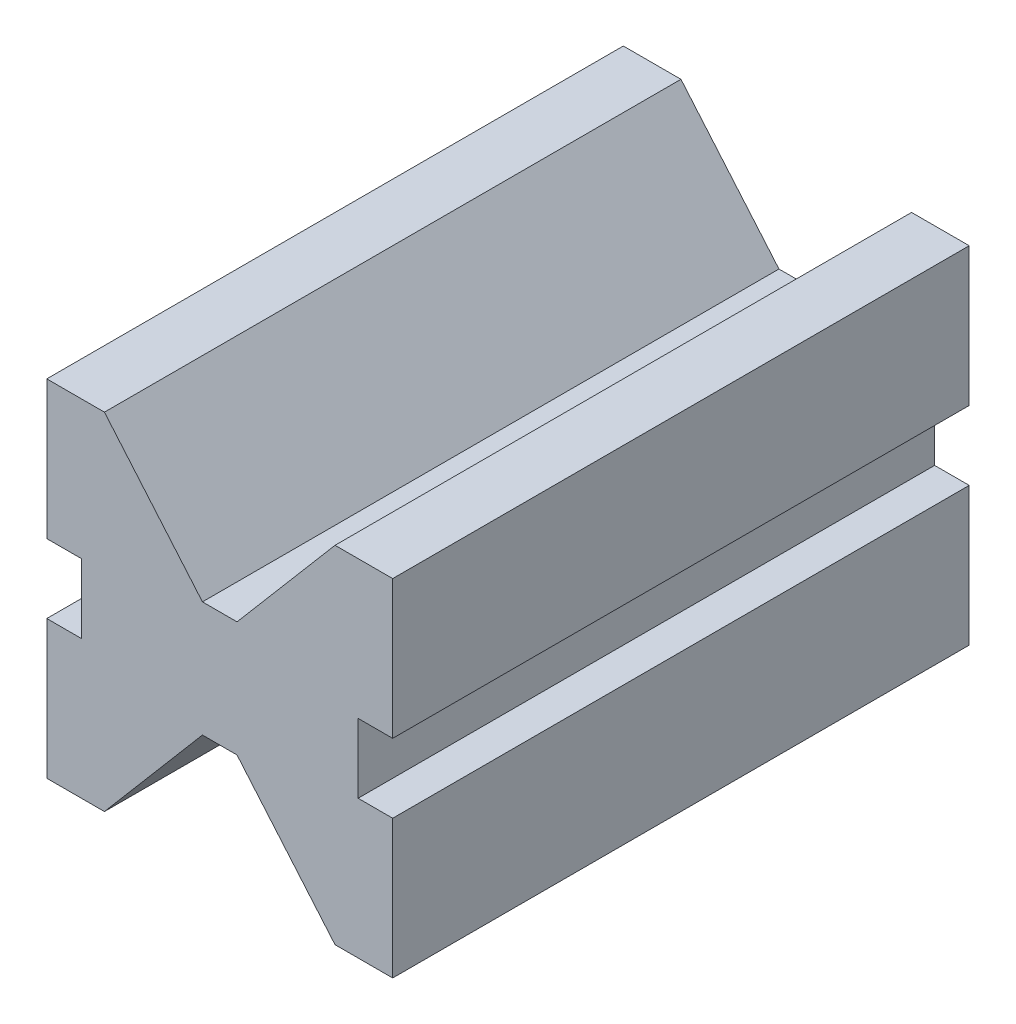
ISO-10303-21;
HEADER;
FILE_DESCRIPTION(('STEP AP214'),'2;1');
FILE_NAME('part.step','',(''),(''),'','','');
FILE_SCHEMA(('AUTOMOTIVE_DESIGN { 1 0 10303 214 1 1 1 1 }'));
ENDSEC;
DATA;
#1=APPLICATION_CONTEXT('core data for automotive mechanical design processes');
#2=APPLICATION_PROTOCOL_DEFINITION('international standard','automotive_design',2000,#1);
#3=PRODUCT_CONTEXT('',#1,'mechanical');
#4=PRODUCT('Part','Part','',(#3));
#5=PRODUCT_RELATED_PRODUCT_CATEGORY('part','',(#4));
#6=PRODUCT_DEFINITION_FORMATION('','',#4);
#7=PRODUCT_DEFINITION_CONTEXT('part definition',#1,'design');
#8=PRODUCT_DEFINITION('design','',#6,#7);
#9=PRODUCT_DEFINITION_SHAPE('','',#8);
#10=(LENGTH_UNIT() NAMED_UNIT(*) SI_UNIT(.MILLI.,.METRE.));
#11=(NAMED_UNIT(*) PLANE_ANGLE_UNIT() SI_UNIT($,.RADIAN.));
#12=(NAMED_UNIT(*) SI_UNIT($,.STERADIAN.) SOLID_ANGLE_UNIT());
#13=UNCERTAINTY_MEASURE_WITH_UNIT(LENGTH_MEASURE(1.E-05),#10,'distance_accuracy_value','');
#14=(GEOMETRIC_REPRESENTATION_CONTEXT(3) GLOBAL_UNCERTAINTY_ASSIGNED_CONTEXT((#13)) GLOBAL_UNIT_ASSIGNED_CONTEXT((#10,
#11,#12)) REPRESENTATION_CONTEXT('',''));
#15=CARTESIAN_POINT('',(0.,0.,0.));
#16=DIRECTION('',(0.,0.,1.));
#17=DIRECTION('',(1.,0.,0.));
#18=AXIS2_PLACEMENT_3D('',#15,#16,#17);
#19=CARTESIAN_POINT('',(-20.,-30.,50.));
#20=DIRECTION('',(-0.761939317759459,0.647648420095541,0.));
#21=DIRECTION('',(-0.647648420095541,-0.761939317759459,0.));
#22=AXIS2_PLACEMENT_3D('',#19,#20,#21);
#23=PLANE('',#22);
#24=DIRECTION('',(0.647648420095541,0.761939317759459,0.));
#25=VECTOR('',#24,1.);
#26=CARTESIAN_POINT('',(-20.,-30.,-50.));
#27=LINE('',#26,#25);
#28=CARTESIAN_POINT('',(-20.,-30.,-50.));
#29=VERTEX_POINT('',#28);
#30=CARTESIAN_POINT('',(-3.,-10.,-50.));
#31=VERTEX_POINT('',#30);
#32=EDGE_CURVE('E206',#29,#31,#27,.T.);
#33=ORIENTED_EDGE('',*,*,#32,.T.);
#34=DIRECTION('',(0.,0.,-1.));
#35=VECTOR('',#34,1.);
#36=CARTESIAN_POINT('',(-3.,-10.,50.));
#37=LINE('',#36,#35);
#38=CARTESIAN_POINT('',(-3.,-10.,50.));
#39=VERTEX_POINT('',#38);
#40=EDGE_CURVE('E11',#39,#31,#37,.T.);
#41=ORIENTED_EDGE('',*,*,#40,.F.);
#42=DIRECTION('',(0.647648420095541,0.761939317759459,0.));
#43=VECTOR('',#42,1.);
#44=CARTESIAN_POINT('',(-20.,-30.,50.));
#45=LINE('',#44,#43);
#46=CARTESIAN_POINT('',(-20.,-30.,50.));
#47=VERTEX_POINT('',#46);
#48=EDGE_CURVE('E244',#47,#39,#45,.T.);
#49=ORIENTED_EDGE('',*,*,#48,.F.);
#50=DIRECTION('',(0.,0.,-1.));
#51=VECTOR('',#50,1.);
#52=CARTESIAN_POINT('',(-20.,-30.,50.));
#53=LINE('',#52,#51);
#54=EDGE_CURVE('E202',#47,#29,#53,.T.);
#55=ORIENTED_EDGE('',*,*,#54,.T.);
#56=EDGE_LOOP('',(#33,#41,#49,#55));
#57=FACE_BOUND('',#56,.T.);
#58=ADVANCED_FACE('F38',(#57),#23,.F.);
#59=CARTESIAN_POINT('',(-3.,-10.,50.));
#60=DIRECTION('',(0.,1.,0.));
#61=DIRECTION('',(0.,0.,1.));
#62=AXIS2_PLACEMENT_3D('',#59,#60,#61);
#63=PLANE('',#62);
#64=DIRECTION('',(1.,0.,0.));
#65=VECTOR('',#64,1.);
#66=CARTESIAN_POINT('',(-3.,-10.,-50.));
#67=LINE('',#66,#65);
#68=CARTESIAN_POINT('',(3.,-10.,-50.));
#69=VERTEX_POINT('',#68);
#70=EDGE_CURVE('E209',#31,#69,#67,.T.);
#71=ORIENTED_EDGE('',*,*,#70,.T.);
#72=DIRECTION('',(0.,0.,-1.));
#73=VECTOR('',#72,1.);
#74=CARTESIAN_POINT('',(3.,-10.,50.));
#75=LINE('',#74,#73);
#76=CARTESIAN_POINT('',(3.,-10.,50.));
#77=VERTEX_POINT('',#76);
#78=EDGE_CURVE('E46',#77,#69,#75,.T.);
#79=ORIENTED_EDGE('',*,*,#78,.F.);
#80=DIRECTION('',(1.,0.,0.));
#81=VECTOR('',#80,1.);
#82=CARTESIAN_POINT('',(-3.,-10.,50.));
#83=LINE('',#82,#81);
#84=EDGE_CURVE('E133',#39,#77,#83,.T.);
#85=ORIENTED_EDGE('',*,*,#84,.F.);
#86=ORIENTED_EDGE('',*,*,#40,.T.);
#87=EDGE_LOOP('',(#71,#79,#85,#86));
#88=FACE_BOUND('',#87,.T.);
#89=ADVANCED_FACE('F362',(#88),#63,.F.);
#90=CARTESIAN_POINT('',(3.,-10.,50.));
#91=DIRECTION('',(0.761939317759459,0.647648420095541,0.));
#92=DIRECTION('',(-0.647648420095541,0.761939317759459,0.));
#93=AXIS2_PLACEMENT_3D('',#90,#91,#92);
#94=PLANE('',#93);
#95=DIRECTION('',(0.647648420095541,-0.761939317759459,0.));
#96=VECTOR('',#95,1.);
#97=CARTESIAN_POINT('',(3.,-10.,-50.));
#98=LINE('',#97,#96);
#99=CARTESIAN_POINT('',(20.,-30.,-50.));
#100=VERTEX_POINT('',#99);
#101=EDGE_CURVE('E211',#69,#100,#98,.T.);
#102=ORIENTED_EDGE('',*,*,#101,.T.);
#103=DIRECTION('',(0.,0.,-1.));
#104=VECTOR('',#103,1.);
#105=CARTESIAN_POINT('',(20.,-30.,50.));
#106=LINE('',#105,#104);
#107=CARTESIAN_POINT('',(20.,-30.,50.));
#108=VERTEX_POINT('',#107);
#109=EDGE_CURVE('E287',#108,#100,#106,.T.);
#110=ORIENTED_EDGE('',*,*,#109,.F.);
#111=DIRECTION('',(0.647648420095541,-0.761939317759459,0.));
#112=VECTOR('',#111,1.);
#113=CARTESIAN_POINT('',(3.,-10.,50.));
#114=LINE('',#113,#112);
#115=EDGE_CURVE('E295',#77,#108,#114,.T.);
#116=ORIENTED_EDGE('',*,*,#115,.F.);
#117=ORIENTED_EDGE('',*,*,#78,.T.);
#118=EDGE_LOOP('',(#102,#110,#116,#117));
#119=FACE_BOUND('',#118,.T.);
#120=ADVANCED_FACE('F293',(#119),#94,.F.);
#121=CARTESIAN_POINT('',(20.,-30.,50.));
#122=DIRECTION('',(0.,1.,0.));
#123=DIRECTION('',(-1.,0.,0.));
#124=AXIS2_PLACEMENT_3D('',#121,#122,#123);
#125=PLANE('',#124);
#126=DIRECTION('',(1.,0.,0.));
#127=VECTOR('',#126,1.);
#128=CARTESIAN_POINT('',(20.,-30.,-50.));
#129=LINE('',#128,#127);
#130=CARTESIAN_POINT('',(30.,-30.,-50.));
#131=VERTEX_POINT('',#130);
#132=EDGE_CURVE('E213',#100,#131,#129,.T.);
#133=ORIENTED_EDGE('',*,*,#132,.T.);
#134=DIRECTION('',(0.,0.,-1.));
#135=VECTOR('',#134,1.);
#136=CARTESIAN_POINT('',(30.,-30.,50.));
#137=LINE('',#136,#135);
#138=CARTESIAN_POINT('',(30.,-30.,50.));
#139=VERTEX_POINT('',#138);
#140=EDGE_CURVE('E284',#139,#131,#137,.T.);
#141=ORIENTED_EDGE('',*,*,#140,.F.);
#142=DIRECTION('',(1.,0.,0.));
#143=VECTOR('',#142,1.);
#144=CARTESIAN_POINT('',(20.,-30.,50.));
#145=LINE('',#144,#143);
#146=EDGE_CURVE('E313',#108,#139,#145,.T.);
#147=ORIENTED_EDGE('',*,*,#146,.F.);
#148=ORIENTED_EDGE('',*,*,#109,.T.);
#149=EDGE_LOOP('',(#133,#141,#147,#148));
#150=FACE_BOUND('',#149,.T.);
#151=ADVANCED_FACE('F304',(#150),#125,.F.);
#152=CARTESIAN_POINT('',(30.,-30.,50.));
#153=DIRECTION('',(-1.,0.,0.));
#154=DIRECTION('',(0.,-1.,0.));
#155=AXIS2_PLACEMENT_3D('',#152,#153,#154);
#156=PLANE('',#155);
#157=DIRECTION('',(0.,1.,0.));
#158=VECTOR('',#157,1.);
#159=CARTESIAN_POINT('',(30.,-30.,-50.));
#160=LINE('',#159,#158);
#161=CARTESIAN_POINT('',(30.,-6.,-50.));
#162=VERTEX_POINT('',#161);
#163=EDGE_CURVE('E215',#131,#162,#160,.T.);
#164=ORIENTED_EDGE('',*,*,#163,.T.);
#165=DIRECTION('',(0.,0.,-1.));
#166=VECTOR('',#165,1.);
#167=CARTESIAN_POINT('',(30.,-6.,50.));
#168=LINE('',#167,#166);
#169=CARTESIAN_POINT('',(30.,-6.,50.));
#170=VERTEX_POINT('',#169);
#171=EDGE_CURVE('E281',#170,#162,#168,.T.);
#172=ORIENTED_EDGE('',*,*,#171,.F.);
#173=DIRECTION('',(0.,1.,0.));
#174=VECTOR('',#173,1.);
#175=CARTESIAN_POINT('',(30.,-30.,50.));
#176=LINE('',#175,#174);
#177=EDGE_CURVE('E310',#139,#170,#176,.T.);
#178=ORIENTED_EDGE('',*,*,#177,.F.);
#179=ORIENTED_EDGE('',*,*,#140,.T.);
#180=EDGE_LOOP('',(#164,#172,#178,#179));
#181=FACE_BOUND('',#180,.T.);
#182=ADVANCED_FACE('F308',(#181),#156,.F.);
#183=CARTESIAN_POINT('',(30.,-6.,50.));
#184=DIRECTION('',(0.,-1.,0.));
#185=DIRECTION('',(0.,0.,-1.));
#186=AXIS2_PLACEMENT_3D('',#183,#184,#185);
#187=PLANE('',#186);
#188=DIRECTION('',(-1.,0.,0.));
#189=VECTOR('',#188,1.);
#190=CARTESIAN_POINT('',(30.,-6.,-50.));
#191=LINE('',#190,#189);
#192=CARTESIAN_POINT('',(24.,-6.,-50.));
#193=VERTEX_POINT('',#192);
#194=EDGE_CURVE('E217',#162,#193,#191,.T.);
#195=ORIENTED_EDGE('',*,*,#194,.T.);
#196=DIRECTION('',(0.,0.,-1.));
#197=VECTOR('',#196,1.);
#198=CARTESIAN_POINT('',(24.,-6.,50.));
#199=LINE('',#198,#197);
#200=CARTESIAN_POINT('',(24.,-6.,50.));
#201=VERTEX_POINT('',#200);
#202=EDGE_CURVE('E278',#201,#193,#199,.T.);
#203=ORIENTED_EDGE('',*,*,#202,.F.);
#204=DIRECTION('',(-1.,0.,0.));
#205=VECTOR('',#204,1.);
#206=CARTESIAN_POINT('',(30.,-6.,50.));
#207=LINE('',#206,#205);
#208=EDGE_CURVE('E312',#170,#201,#207,.T.);
#209=ORIENTED_EDGE('',*,*,#208,.F.);
#210=ORIENTED_EDGE('',*,*,#171,.T.);
#211=EDGE_LOOP('',(#195,#203,#209,#210));
#212=FACE_BOUND('',#211,.T.);
#213=ADVANCED_FACE('F375',(#212),#187,.F.);
#214=CARTESIAN_POINT('',(24.,-6.,50.));
#215=DIRECTION('',(-1.,0.,0.));
#216=DIRECTION('',(0.,0.,1.));
#217=AXIS2_PLACEMENT_3D('',#214,#215,#216);
#218=PLANE('',#217);
#219=DIRECTION('',(0.,1.,0.));
#220=VECTOR('',#219,1.);
#221=CARTESIAN_POINT('',(24.,-6.,-50.));
#222=LINE('',#221,#220);
#223=CARTESIAN_POINT('',(24.,6.,-50.));
#224=VERTEX_POINT('',#223);
#225=EDGE_CURVE('E219',#193,#224,#222,.T.);
#226=ORIENTED_EDGE('',*,*,#225,.T.);
#227=DIRECTION('',(0.,0.,-1.));
#228=VECTOR('',#227,1.);
#229=CARTESIAN_POINT('',(24.,6.,50.));
#230=LINE('',#229,#228);
#231=CARTESIAN_POINT('',(24.,6.,50.));
#232=VERTEX_POINT('',#231);
#233=EDGE_CURVE('E275',#232,#224,#230,.T.);
#234=ORIENTED_EDGE('',*,*,#233,.F.);
#235=DIRECTION('',(0.,1.,0.));
#236=VECTOR('',#235,1.);
#237=CARTESIAN_POINT('',(24.,-6.,50.));
#238=LINE('',#237,#236);
#239=EDGE_CURVE('E315',#201,#232,#238,.T.);
#240=ORIENTED_EDGE('',*,*,#239,.F.);
#241=ORIENTED_EDGE('',*,*,#202,.T.);
#242=EDGE_LOOP('',(#226,#234,#240,#241));
#243=FACE_BOUND('',#242,.T.);
#244=ADVANCED_FACE('F378',(#243),#218,.F.);
#245=CARTESIAN_POINT('',(24.,6.,50.));
#246=DIRECTION('',(0.,1.,0.));
#247=DIRECTION('',(0.,0.,1.));
#248=AXIS2_PLACEMENT_3D('',#245,#246,#247);
#249=PLANE('',#248);
#250=DIRECTION('',(1.,0.,0.));
#251=VECTOR('',#250,1.);
#252=CARTESIAN_POINT('',(24.,6.,-50.));
#253=LINE('',#252,#251);
#254=CARTESIAN_POINT('',(30.,6.,-50.));
#255=VERTEX_POINT('',#254);
#256=EDGE_CURVE('E221',#224,#255,#253,.T.);
#257=ORIENTED_EDGE('',*,*,#256,.T.);
#258=DIRECTION('',(0.,0.,-1.));
#259=VECTOR('',#258,1.);
#260=CARTESIAN_POINT('',(30.,6.,50.));
#261=LINE('',#260,#259);
#262=CARTESIAN_POINT('',(30.,6.,50.));
#263=VERTEX_POINT('',#262);
#264=EDGE_CURVE('E272',#263,#255,#261,.T.);
#265=ORIENTED_EDGE('',*,*,#264,.F.);
#266=DIRECTION('',(1.,0.,0.));
#267=VECTOR('',#266,1.);
#268=CARTESIAN_POINT('',(24.,6.,50.));
#269=LINE('',#268,#267);
#270=EDGE_CURVE('E321',#232,#263,#269,.T.);
#271=ORIENTED_EDGE('',*,*,#270,.F.);
#272=ORIENTED_EDGE('',*,*,#233,.T.);
#273=EDGE_LOOP('',(#257,#265,#271,#272));
#274=FACE_BOUND('',#273,.T.);
#275=ADVANCED_FACE('F382',(#274),#249,.F.);
#276=CARTESIAN_POINT('',(30.,6.,50.));
#277=DIRECTION('',(-1.,0.,0.));
#278=DIRECTION('',(0.,-1.,0.));
#279=AXIS2_PLACEMENT_3D('',#276,#277,#278);
#280=PLANE('',#279);
#281=DIRECTION('',(0.,1.,0.));
#282=VECTOR('',#281,1.);
#283=CARTESIAN_POINT('',(30.,6.,-50.));
#284=LINE('',#283,#282);
#285=CARTESIAN_POINT('',(30.,30.,-50.));
#286=VERTEX_POINT('',#285);
#287=EDGE_CURVE('E223',#255,#286,#284,.T.);
#288=ORIENTED_EDGE('',*,*,#287,.T.);
#289=DIRECTION('',(0.,0.,-1.));
#290=VECTOR('',#289,1.);
#291=CARTESIAN_POINT('',(30.,30.,50.));
#292=LINE('',#291,#290);
#293=CARTESIAN_POINT('',(30.,30.,50.));
#294=VERTEX_POINT('',#293);
#295=EDGE_CURVE('E269',#294,#286,#292,.T.);
#296=ORIENTED_EDGE('',*,*,#295,.F.);
#297=DIRECTION('',(0.,1.,0.));
#298=VECTOR('',#297,1.);
#299=CARTESIAN_POINT('',(30.,6.,50.));
#300=LINE('',#299,#298);
#301=EDGE_CURVE('E323',#263,#294,#300,.T.);
#302=ORIENTED_EDGE('',*,*,#301,.F.);
#303=ORIENTED_EDGE('',*,*,#264,.T.);
#304=EDGE_LOOP('',(#288,#296,#302,#303));
#305=FACE_BOUND('',#304,.T.);
#306=ADVANCED_FACE('F386',(#305),#280,.F.);
#307=CARTESIAN_POINT('',(30.,30.,50.));
#308=DIRECTION('',(0.,-1.,0.));
#309=DIRECTION('',(1.,0.,0.));
#310=AXIS2_PLACEMENT_3D('',#307,#308,#309);
#311=PLANE('',#310);
#312=DIRECTION('',(-1.,0.,0.));
#313=VECTOR('',#312,1.);
#314=CARTESIAN_POINT('',(30.,30.,-50.));
#315=LINE('',#314,#313);
#316=CARTESIAN_POINT('',(20.,30.,-50.));
#317=VERTEX_POINT('',#316);
#318=EDGE_CURVE('E225',#286,#317,#315,.T.);
#319=ORIENTED_EDGE('',*,*,#318,.T.);
#320=DIRECTION('',(0.,0.,-1.));
#321=VECTOR('',#320,1.);
#322=CARTESIAN_POINT('',(20.,30.,50.));
#323=LINE('',#322,#321);
#324=CARTESIAN_POINT('',(20.,30.,50.));
#325=VERTEX_POINT('',#324);
#326=EDGE_CURVE('E266',#325,#317,#323,.T.);
#327=ORIENTED_EDGE('',*,*,#326,.F.);
#328=DIRECTION('',(-1.,0.,0.));
#329=VECTOR('',#328,1.);
#330=CARTESIAN_POINT('',(30.,30.,50.));
#331=LINE('',#330,#329);
#332=EDGE_CURVE('E325',#294,#325,#331,.T.);
#333=ORIENTED_EDGE('',*,*,#332,.F.);
#334=ORIENTED_EDGE('',*,*,#295,.T.);
#335=EDGE_LOOP('',(#319,#327,#333,#334));
#336=FACE_BOUND('',#335,.T.);
#337=ADVANCED_FACE('F390',(#336),#311,.F.);
#338=CARTESIAN_POINT('',(20.,30.,50.));
#339=DIRECTION('',(0.761939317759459,-0.647648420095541,0.));
#340=DIRECTION('',(0.647648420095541,0.761939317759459,0.));
#341=AXIS2_PLACEMENT_3D('',#338,#339,#340);
#342=PLANE('',#341);
#343=DIRECTION('',(-0.647648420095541,-0.761939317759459,0.));
#344=VECTOR('',#343,1.);
#345=CARTESIAN_POINT('',(20.,30.,-50.));
#346=LINE('',#345,#344);
#347=CARTESIAN_POINT('',(3.,10.,-50.));
#348=VERTEX_POINT('',#347);
#349=EDGE_CURVE('E227',#317,#348,#346,.T.);
#350=ORIENTED_EDGE('',*,*,#349,.T.);
#351=DIRECTION('',(0.,0.,-1.));
#352=VECTOR('',#351,1.);
#353=CARTESIAN_POINT('',(3.,10.,50.));
#354=LINE('',#353,#352);
#355=CARTESIAN_POINT('',(3.,10.,50.));
#356=VERTEX_POINT('',#355);
#357=EDGE_CURVE('E263',#356,#348,#354,.T.);
#358=ORIENTED_EDGE('',*,*,#357,.F.);
#359=DIRECTION('',(-0.647648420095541,-0.761939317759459,0.));
#360=VECTOR('',#359,1.);
#361=CARTESIAN_POINT('',(20.,30.,50.));
#362=LINE('',#361,#360);
#363=EDGE_CURVE('E327',#325,#356,#362,.T.);
#364=ORIENTED_EDGE('',*,*,#363,.F.);
#365=ORIENTED_EDGE('',*,*,#326,.T.);
#366=EDGE_LOOP('',(#350,#358,#364,#365));
#367=FACE_BOUND('',#366,.T.);
#368=ADVANCED_FACE('F394',(#367),#342,.F.);
#369=CARTESIAN_POINT('',(3.,10.,50.));
#370=DIRECTION('',(0.,-1.,0.));
#371=DIRECTION('',(0.,0.,-1.));
#372=AXIS2_PLACEMENT_3D('',#369,#370,#371);
#373=PLANE('',#372);
#374=DIRECTION('',(-1.,0.,0.));
#375=VECTOR('',#374,1.);
#376=CARTESIAN_POINT('',(3.,10.,-50.));
#377=LINE('',#376,#375);
#378=CARTESIAN_POINT('',(-3.,10.,-50.));
#379=VERTEX_POINT('',#378);
#380=EDGE_CURVE('E229',#348,#379,#377,.T.);
#381=ORIENTED_EDGE('',*,*,#380,.T.);
#382=DIRECTION('',(0.,0.,-1.));
#383=VECTOR('',#382,1.);
#384=CARTESIAN_POINT('',(-3.,10.,50.));
#385=LINE('',#384,#383);
#386=CARTESIAN_POINT('',(-3.,10.,50.));
#387=VERTEX_POINT('',#386);
#388=EDGE_CURVE('E260',#387,#379,#385,.T.);
#389=ORIENTED_EDGE('',*,*,#388,.F.);
#390=DIRECTION('',(-1.,0.,0.));
#391=VECTOR('',#390,1.);
#392=CARTESIAN_POINT('',(3.,10.,50.));
#393=LINE('',#392,#391);
#394=EDGE_CURVE('E329',#356,#387,#393,.T.);
#395=ORIENTED_EDGE('',*,*,#394,.F.);
#396=ORIENTED_EDGE('',*,*,#357,.T.);
#397=EDGE_LOOP('',(#381,#389,#395,#396));
#398=FACE_BOUND('',#397,.T.);
#399=ADVANCED_FACE('F398',(#398),#373,.F.);
#400=CARTESIAN_POINT('',(-3.,10.,50.));
#401=DIRECTION('',(-0.761939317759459,-0.647648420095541,0.));
#402=DIRECTION('',(0.647648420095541,-0.761939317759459,0.));
#403=AXIS2_PLACEMENT_3D('',#400,#401,#402);
#404=PLANE('',#403);
#405=DIRECTION('',(-0.647648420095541,0.761939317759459,0.));
#406=VECTOR('',#405,1.);
#407=CARTESIAN_POINT('',(-3.,10.,-50.));
#408=LINE('',#407,#406);
#409=CARTESIAN_POINT('',(-20.,30.,-50.));
#410=VERTEX_POINT('',#409);
#411=EDGE_CURVE('E231',#379,#410,#408,.T.);
#412=ORIENTED_EDGE('',*,*,#411,.T.);
#413=DIRECTION('',(0.,0.,-1.));
#414=VECTOR('',#413,1.);
#415=CARTESIAN_POINT('',(-20.,30.,50.));
#416=LINE('',#415,#414);
#417=CARTESIAN_POINT('',(-20.,30.,50.));
#418=VERTEX_POINT('',#417);
#419=EDGE_CURVE('E257',#418,#410,#416,.T.);
#420=ORIENTED_EDGE('',*,*,#419,.F.);
#421=DIRECTION('',(-0.647648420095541,0.761939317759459,0.));
#422=VECTOR('',#421,1.);
#423=CARTESIAN_POINT('',(-3.,10.,50.));
#424=LINE('',#423,#422);
#425=EDGE_CURVE('E331',#387,#418,#424,.T.);
#426=ORIENTED_EDGE('',*,*,#425,.F.);
#427=ORIENTED_EDGE('',*,*,#388,.T.);
#428=EDGE_LOOP('',(#412,#420,#426,#427));
#429=FACE_BOUND('',#428,.T.);
#430=ADVANCED_FACE('F402',(#429),#404,.F.);
#431=CARTESIAN_POINT('',(-20.,30.,50.));
#432=DIRECTION('',(0.,-1.,0.));
#433=DIRECTION('',(1.,0.,0.));
#434=AXIS2_PLACEMENT_3D('',#431,#432,#433);
#435=PLANE('',#434);
#436=DIRECTION('',(-1.,0.,0.));
#437=VECTOR('',#436,1.);
#438=CARTESIAN_POINT('',(-20.,30.,-50.));
#439=LINE('',#438,#437);
#440=CARTESIAN_POINT('',(-30.,30.,-50.));
#441=VERTEX_POINT('',#440);
#442=EDGE_CURVE('E233',#410,#441,#439,.T.);
#443=ORIENTED_EDGE('',*,*,#442,.T.);
#444=DIRECTION('',(0.,0.,-1.));
#445=VECTOR('',#444,1.);
#446=CARTESIAN_POINT('',(-30.,30.,50.));
#447=LINE('',#446,#445);
#448=CARTESIAN_POINT('',(-30.,30.,50.));
#449=VERTEX_POINT('',#448);
#450=EDGE_CURVE('E254',#449,#441,#447,.T.);
#451=ORIENTED_EDGE('',*,*,#450,.F.);
#452=DIRECTION('',(-1.,0.,0.));
#453=VECTOR('',#452,1.);
#454=CARTESIAN_POINT('',(-20.,30.,50.));
#455=LINE('',#454,#453);
#456=EDGE_CURVE('E333',#418,#449,#455,.T.);
#457=ORIENTED_EDGE('',*,*,#456,.F.);
#458=ORIENTED_EDGE('',*,*,#419,.T.);
#459=EDGE_LOOP('',(#443,#451,#457,#458));
#460=FACE_BOUND('',#459,.T.);
#461=ADVANCED_FACE('F406',(#460),#435,.F.);
#462=CARTESIAN_POINT('',(-30.,30.,50.));
#463=DIRECTION('',(1.,0.,0.));
#464=DIRECTION('',(0.,1.,0.));
#465=AXIS2_PLACEMENT_3D('',#462,#463,#464);
#466=PLANE('',#465);
#467=DIRECTION('',(0.,-1.,0.));
#468=VECTOR('',#467,1.);
#469=CARTESIAN_POINT('',(-30.,30.,-50.));
#470=LINE('',#469,#468);
#471=CARTESIAN_POINT('',(-30.,5.99999999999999,-50.));
#472=VERTEX_POINT('',#471);
#473=EDGE_CURVE('E235',#441,#472,#470,.T.);
#474=ORIENTED_EDGE('',*,*,#473,.T.);
#475=DIRECTION('',(0.,0.,-1.));
#476=VECTOR('',#475,1.);
#477=CARTESIAN_POINT('',(-30.,5.99999999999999,50.));
#478=LINE('',#477,#476);
#479=CARTESIAN_POINT('',(-30.,5.99999999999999,50.));
#480=VERTEX_POINT('',#479);
#481=EDGE_CURVE('E251',#480,#472,#478,.T.);
#482=ORIENTED_EDGE('',*,*,#481,.F.);
#483=DIRECTION('',(0.,-1.,0.));
#484=VECTOR('',#483,1.);
#485=CARTESIAN_POINT('',(-30.,30.,50.));
#486=LINE('',#485,#484);
#487=EDGE_CURVE('E335',#449,#480,#486,.T.);
#488=ORIENTED_EDGE('',*,*,#487,.F.);
#489=ORIENTED_EDGE('',*,*,#450,.T.);
#490=EDGE_LOOP('',(#474,#482,#488,#489));
#491=FACE_BOUND('',#490,.T.);
#492=ADVANCED_FACE('F410',(#491),#466,.F.);
#493=CARTESIAN_POINT('',(-30.,5.99999999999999,50.));
#494=DIRECTION('',(0.,1.,0.));
#495=DIRECTION('',(-1.,0.,0.));
#496=AXIS2_PLACEMENT_3D('',#493,#494,#495);
#497=PLANE('',#496);
#498=DIRECTION('',(1.,0.,0.));
#499=VECTOR('',#498,1.);
#500=CARTESIAN_POINT('',(-30.,5.99999999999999,-50.));
#501=LINE('',#500,#499);
#502=CARTESIAN_POINT('',(-24.,5.99999999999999,-50.));
#503=VERTEX_POINT('',#502);
#504=EDGE_CURVE('E237',#472,#503,#501,.T.);
#505=ORIENTED_EDGE('',*,*,#504,.T.);
#506=DIRECTION('',(0.,0.,-1.));
#507=VECTOR('',#506,1.);
#508=CARTESIAN_POINT('',(-24.,5.99999999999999,50.));
#509=LINE('',#508,#507);
#510=CARTESIAN_POINT('',(-24.,5.99999999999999,50.));
#511=VERTEX_POINT('',#510);
#512=EDGE_CURVE('E248',#511,#503,#509,.T.);
#513=ORIENTED_EDGE('',*,*,#512,.F.);
#514=DIRECTION('',(1.,0.,0.));
#515=VECTOR('',#514,1.);
#516=CARTESIAN_POINT('',(-30.,5.99999999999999,50.));
#517=LINE('',#516,#515);
#518=EDGE_CURVE('E337',#480,#511,#517,.T.);
#519=ORIENTED_EDGE('',*,*,#518,.F.);
#520=ORIENTED_EDGE('',*,*,#481,.T.);
#521=EDGE_LOOP('',(#505,#513,#519,#520));
#522=FACE_BOUND('',#521,.T.);
#523=ADVANCED_FACE('F343',(#522),#497,.F.);
#524=CARTESIAN_POINT('',(-24.,5.99999999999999,50.));
#525=DIRECTION('',(1.,0.,0.));
#526=DIRECTION('',(0.,0.,-1.));
#527=AXIS2_PLACEMENT_3D('',#524,#525,#526);
#528=PLANE('',#527);
#529=DIRECTION('',(0.,-1.,0.));
#530=VECTOR('',#529,1.);
#531=CARTESIAN_POINT('',(-24.,5.99999999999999,-50.));
#532=LINE('',#531,#530);
#533=CARTESIAN_POINT('',(-24.,-6.00000000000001,-50.));
#534=VERTEX_POINT('',#533);
#535=EDGE_CURVE('E239',#503,#534,#532,.T.);
#536=ORIENTED_EDGE('',*,*,#535,.T.);
#537=DIRECTION('',(0.,0.,-1.));
#538=VECTOR('',#537,1.);
#539=CARTESIAN_POINT('',(-24.,-6.00000000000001,50.));
#540=LINE('',#539,#538);
#541=CARTESIAN_POINT('',(-24.,-6.00000000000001,50.));
#542=VERTEX_POINT('',#541);
#543=EDGE_CURVE('E197',#542,#534,#540,.T.);
#544=ORIENTED_EDGE('',*,*,#543,.F.);
#545=DIRECTION('',(0.,-1.,0.));
#546=VECTOR('',#545,1.);
#547=CARTESIAN_POINT('',(-24.,5.99999999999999,50.));
#548=LINE('',#547,#546);
#549=EDGE_CURVE('E188',#511,#542,#548,.T.);
#550=ORIENTED_EDGE('',*,*,#549,.F.);
#551=ORIENTED_EDGE('',*,*,#512,.T.);
#552=EDGE_LOOP('',(#536,#544,#550,#551));
#553=FACE_BOUND('',#552,.T.);
#554=ADVANCED_FACE('F347',(#553),#528,.F.);
#555=CARTESIAN_POINT('',(-24.,-6.00000000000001,50.));
#556=DIRECTION('',(0.,-1.,0.));
#557=DIRECTION('',(1.,0.,0.));
#558=AXIS2_PLACEMENT_3D('',#555,#556,#557);
#559=PLANE('',#558);
#560=DIRECTION('',(-1.,0.,0.));
#561=VECTOR('',#560,1.);
#562=CARTESIAN_POINT('',(-24.,-6.00000000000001,-50.));
#563=LINE('',#562,#561);
#564=CARTESIAN_POINT('',(-30.,-6.00000000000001,-50.));
#565=VERTEX_POINT('',#564);
#566=EDGE_CURVE('E196',#534,#565,#563,.T.);
#567=ORIENTED_EDGE('',*,*,#566,.T.);
#568=DIRECTION('',(0.,0.,-1.));
#569=VECTOR('',#568,1.);
#570=CARTESIAN_POINT('',(-30.,-6.00000000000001,50.));
#571=LINE('',#570,#569);
#572=CARTESIAN_POINT('',(-30.,-6.00000000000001,50.));
#573=VERTEX_POINT('',#572);
#574=EDGE_CURVE('E193',#573,#565,#571,.T.);
#575=ORIENTED_EDGE('',*,*,#574,.F.);
#576=DIRECTION('',(-1.,0.,0.));
#577=VECTOR('',#576,1.);
#578=CARTESIAN_POINT('',(-24.,-6.00000000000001,50.));
#579=LINE('',#578,#577);
#580=EDGE_CURVE('E182',#542,#573,#579,.T.);
#581=ORIENTED_EDGE('',*,*,#580,.F.);
#582=ORIENTED_EDGE('',*,*,#543,.T.);
#583=EDGE_LOOP('',(#567,#575,#581,#582));
#584=FACE_BOUND('',#583,.T.);
#585=ADVANCED_FACE('F194',(#584),#559,.F.);
#586=CARTESIAN_POINT('',(-30.,-6.00000000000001,50.));
#587=DIRECTION('',(1.,0.,0.));
#588=DIRECTION('',(0.,1.,0.));
#589=AXIS2_PLACEMENT_3D('',#586,#587,#588);
#590=PLANE('',#589);
#591=DIRECTION('',(0.,-1.,0.));
#592=VECTOR('',#591,1.);
#593=CARTESIAN_POINT('',(-30.,-6.00000000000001,-50.));
#594=LINE('',#593,#592);
#595=CARTESIAN_POINT('',(-30.,-30.,-50.));
#596=VERTEX_POINT('',#595);
#597=EDGE_CURVE('E119',#565,#596,#594,.T.);
#598=ORIENTED_EDGE('',*,*,#597,.T.);
#599=DIRECTION('',(0.,0.,-1.));
#600=VECTOR('',#599,1.);
#601=CARTESIAN_POINT('',(-30.,-30.,50.));
#602=LINE('',#601,#600);
#603=CARTESIAN_POINT('',(-30.,-30.,50.));
#604=VERTEX_POINT('',#603);
#605=EDGE_CURVE('E198',#604,#596,#602,.T.);
#606=ORIENTED_EDGE('',*,*,#605,.F.);
#607=DIRECTION('',(0.,-1.,0.));
#608=VECTOR('',#607,1.);
#609=CARTESIAN_POINT('',(-30.,-6.00000000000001,50.));
#610=LINE('',#609,#608);
#611=EDGE_CURVE('E186',#573,#604,#610,.T.);
#612=ORIENTED_EDGE('',*,*,#611,.F.);
#613=ORIENTED_EDGE('',*,*,#574,.T.);
#614=EDGE_LOOP('',(#598,#606,#612,#613));
#615=FACE_BOUND('',#614,.T.);
#616=ADVANCED_FACE('F200',(#615),#590,.F.);
#617=CARTESIAN_POINT('',(-30.,-30.,50.));
#618=DIRECTION('',(0.,1.,0.));
#619=DIRECTION('',(0.,0.,1.));
#620=AXIS2_PLACEMENT_3D('',#617,#618,#619);
#621=PLANE('',#620);
#622=DIRECTION('',(1.,0.,0.));
#623=VECTOR('',#622,1.);
#624=CARTESIAN_POINT('',(-30.,-30.,-50.));
#625=LINE('',#624,#623);
#626=EDGE_CURVE('E125',#596,#29,#625,.T.);
#627=ORIENTED_EDGE('',*,*,#626,.T.);
#628=ORIENTED_EDGE('',*,*,#54,.F.);
#629=DIRECTION('',(1.,0.,0.));
#630=VECTOR('',#629,1.);
#631=CARTESIAN_POINT('',(-30.,-30.,50.));
#632=LINE('',#631,#630);
#633=EDGE_CURVE('E54',#604,#47,#632,.T.);
#634=ORIENTED_EDGE('',*,*,#633,.F.);
#635=ORIENTED_EDGE('',*,*,#605,.T.);
#636=EDGE_LOOP('',(#627,#628,#634,#635));
#637=FACE_BOUND('',#636,.T.);
#638=ADVANCED_FACE('F351',(#637),#621,.F.);
#639=CARTESIAN_POINT('',(0.,0.,50.));
#640=DIRECTION('',(0.,0.,-1.));
#641=DIRECTION('',(-1.,0.,0.));
#642=AXIS2_PLACEMENT_3D('',#639,#640,#641);
#643=PLANE('',#642);
#644=ORIENTED_EDGE('',*,*,#48,.T.);
#645=ORIENTED_EDGE('',*,*,#84,.T.);
#646=ORIENTED_EDGE('',*,*,#115,.T.);
#647=ORIENTED_EDGE('',*,*,#146,.T.);
#648=ORIENTED_EDGE('',*,*,#177,.T.);
#649=ORIENTED_EDGE('',*,*,#208,.T.);
#650=ORIENTED_EDGE('',*,*,#239,.T.);
#651=ORIENTED_EDGE('',*,*,#270,.T.);
#652=ORIENTED_EDGE('',*,*,#301,.T.);
#653=ORIENTED_EDGE('',*,*,#332,.T.);
#654=ORIENTED_EDGE('',*,*,#363,.T.);
#655=ORIENTED_EDGE('',*,*,#394,.T.);
#656=ORIENTED_EDGE('',*,*,#425,.T.);
#657=ORIENTED_EDGE('',*,*,#456,.T.);
#658=ORIENTED_EDGE('',*,*,#487,.T.);
#659=ORIENTED_EDGE('',*,*,#518,.T.);
#660=ORIENTED_EDGE('',*,*,#549,.T.);
#661=ORIENTED_EDGE('',*,*,#580,.T.);
#662=ORIENTED_EDGE('',*,*,#611,.T.);
#663=ORIENTED_EDGE('',*,*,#633,.T.);
#664=EDGE_LOOP('',(#644,#645,#646,#647,#648,#649,#650,#651,#652,#653,#654,#655,#656,#657,#658,
#659,#660,#661,#662,#663));
#665=FACE_BOUND('',#664,.T.);
#666=ADVANCED_FACE('F184',(#665),#643,.F.);
#667=CARTESIAN_POINT('',(0.,0.,-50.));
#668=DIRECTION('',(0.,0.,-1.));
#669=DIRECTION('',(-1.,0.,0.));
#670=AXIS2_PLACEMENT_3D('',#667,#668,#669);
#671=PLANE('',#670);
#672=ORIENTED_EDGE('',*,*,#32,.F.);
#673=ORIENTED_EDGE('',*,*,#626,.F.);
#674=ORIENTED_EDGE('',*,*,#597,.F.);
#675=ORIENTED_EDGE('',*,*,#566,.F.);
#676=ORIENTED_EDGE('',*,*,#535,.F.);
#677=ORIENTED_EDGE('',*,*,#504,.F.);
#678=ORIENTED_EDGE('',*,*,#473,.F.);
#679=ORIENTED_EDGE('',*,*,#442,.F.);
#680=ORIENTED_EDGE('',*,*,#411,.F.);
#681=ORIENTED_EDGE('',*,*,#380,.F.);
#682=ORIENTED_EDGE('',*,*,#349,.F.);
#683=ORIENTED_EDGE('',*,*,#318,.F.);
#684=ORIENTED_EDGE('',*,*,#287,.F.);
#685=ORIENTED_EDGE('',*,*,#256,.F.);
#686=ORIENTED_EDGE('',*,*,#225,.F.);
#687=ORIENTED_EDGE('',*,*,#194,.F.);
#688=ORIENTED_EDGE('',*,*,#163,.F.);
#689=ORIENTED_EDGE('',*,*,#132,.F.);
#690=ORIENTED_EDGE('',*,*,#101,.F.);
#691=ORIENTED_EDGE('',*,*,#70,.F.);
#692=EDGE_LOOP('',(#672,#673,#674,#675,#676,#677,#678,#679,#680,#681,#682,#683,#684,#685,#686,
#687,#688,#689,#690,#691));
#693=FACE_BOUND('',#692,.T.);
#694=ADVANCED_FACE('F299',(#693),#671,.T.);
#695=CLOSED_SHELL('',(#58,#89,#120,#151,#182,#213,#244,#275,#306,#337,#368,#399,#430,#461,#492,
#523,#554,#585,#616,#638,#666,#694));
#696=MANIFOLD_SOLID_BREP('B2',#695);
#697=ADVANCED_BREP_SHAPE_REPRESENTATION('',(#18,#696),#14);
#698=SHAPE_DEFINITION_REPRESENTATION(#9,#697);
ENDSEC;
END-ISO-10303-21;
